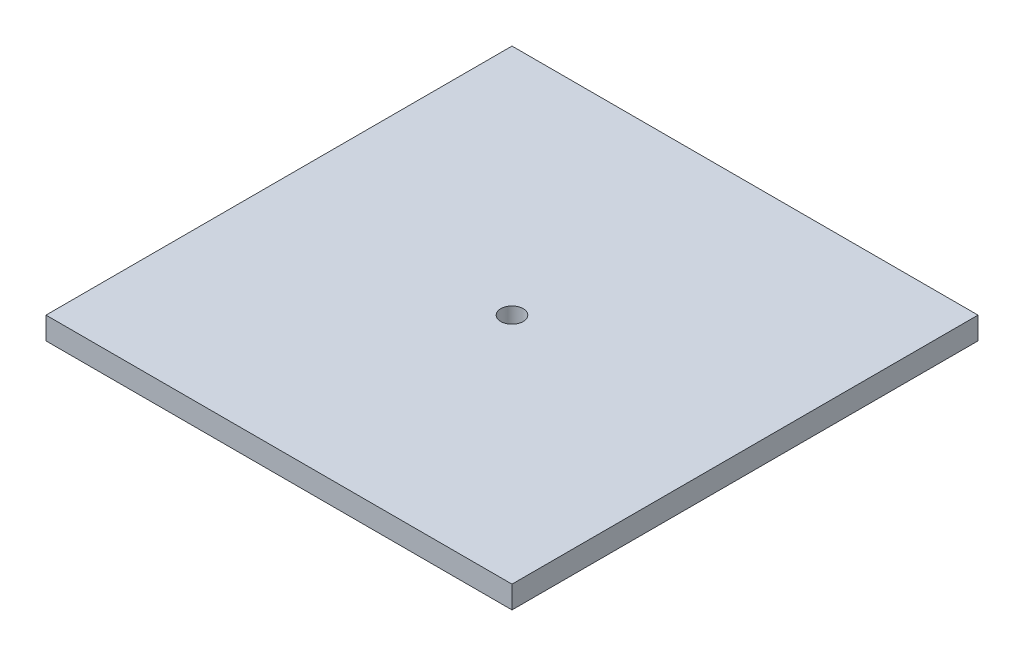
ISO-10303-21;
HEADER;
FILE_DESCRIPTION(('STEP AP214'),'2;1');
FILE_NAME('part.step','',(''),(''),'','','');
FILE_SCHEMA(('AUTOMOTIVE_DESIGN { 1 0 10303 214 1 1 1 1 }'));
ENDSEC;
DATA;
#1=APPLICATION_CONTEXT('core data for automotive mechanical design processes');
#2=APPLICATION_PROTOCOL_DEFINITION('international standard','automotive_design',2000,#1);
#3=PRODUCT_CONTEXT('',#1,'mechanical');
#4=PRODUCT('Part','Part','',(#3));
#5=PRODUCT_RELATED_PRODUCT_CATEGORY('part','',(#4));
#6=PRODUCT_DEFINITION_FORMATION('','',#4);
#7=PRODUCT_DEFINITION_CONTEXT('part definition',#1,'design');
#8=PRODUCT_DEFINITION('design','',#6,#7);
#9=PRODUCT_DEFINITION_SHAPE('','',#8);
#10=(LENGTH_UNIT() NAMED_UNIT(*) SI_UNIT(.MILLI.,.METRE.));
#11=(NAMED_UNIT(*) PLANE_ANGLE_UNIT() SI_UNIT($,.RADIAN.));
#12=(NAMED_UNIT(*) SI_UNIT($,.STERADIAN.) SOLID_ANGLE_UNIT());
#13=UNCERTAINTY_MEASURE_WITH_UNIT(LENGTH_MEASURE(1.E-05),#10,'distance_accuracy_value','');
#14=(GEOMETRIC_REPRESENTATION_CONTEXT(3) GLOBAL_UNCERTAINTY_ASSIGNED_CONTEXT((#13)) GLOBAL_UNIT_ASSIGNED_CONTEXT((#10,
#11,#12)) REPRESENTATION_CONTEXT('',''));
#15=CARTESIAN_POINT('',(0.,0.,0.));
#16=DIRECTION('',(0.,0.,1.));
#17=DIRECTION('',(1.,0.,0.));
#18=AXIS2_PLACEMENT_3D('',#15,#16,#17);
#19=CARTESIAN_POINT('',(0.,6.,-125.));
#20=DIRECTION('',(0.,-1.,0.));
#21=DIRECTION('',(0.,0.,-1.));
#22=AXIS2_PLACEMENT_3D('',#19,#20,#21);
#23=PLANE('',#22);
#24=DIRECTION('',(0.,0.,1.));
#25=VECTOR('',#24,1.);
#26=CARTESIAN_POINT('',(0.,6.,0.));
#27=LINE('',#26,#25);
#28=CARTESIAN_POINT('',(0.,6.,-125.));
#29=VERTEX_POINT('',#28);
#30=CARTESIAN_POINT('',(0.,6.,0.));
#31=VERTEX_POINT('',#30);
#32=EDGE_CURVE('E95',#29,#31,#27,.T.);
#33=ORIENTED_EDGE('',*,*,#32,.T.);
#34=DIRECTION('',(1.,0.,0.));
#35=VECTOR('',#34,1.);
#36=CARTESIAN_POINT('',(0.,6.,0.));
#37=LINE('',#36,#35);
#38=CARTESIAN_POINT('',(125.,6.,0.));
#39=VERTEX_POINT('',#38);
#40=EDGE_CURVE('E80',#31,#39,#37,.T.);
#41=ORIENTED_EDGE('',*,*,#40,.T.);
#42=DIRECTION('',(0.,0.,-1.));
#43=VECTOR('',#42,1.);
#44=CARTESIAN_POINT('',(125.,6.,0.));
#45=LINE('',#44,#43);
#46=CARTESIAN_POINT('',(125.,6.,-125.));
#47=VERTEX_POINT('',#46);
#48=EDGE_CURVE('E46',#39,#47,#45,.T.);
#49=ORIENTED_EDGE('',*,*,#48,.T.);
#50=DIRECTION('',(-1.,0.,0.));
#51=VECTOR('',#50,1.);
#52=CARTESIAN_POINT('',(0.,6.,-125.));
#53=LINE('',#52,#51);
#54=EDGE_CURVE('E41',#47,#29,#53,.T.);
#55=ORIENTED_EDGE('',*,*,#54,.T.);
#56=EDGE_LOOP('',(#33,#41,#49,#55));
#57=FACE_BOUND('',#56,.T.);
#58=CARTESIAN_POINT('',(62.5,6.,-62.5));
#59=DIRECTION('',(0.,1.,0.));
#60=DIRECTION('',(0.,0.,1.));
#61=AXIS2_PLACEMENT_3D('',#58,#59,#60);
#62=CIRCLE('',#61,3.00000000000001);
#63=CARTESIAN_POINT('',(62.5,6.,-59.5));
#64=VERTEX_POINT('',#63);
#65=EDGE_CURVE('E85',#64,#64,#62,.T.);
#66=ORIENTED_EDGE('',*,*,#65,.F.);
#67=EDGE_LOOP('',(#66));
#68=FACE_BOUND('',#67,.T.);
#69=ADVANCED_FACE('F26',(#57,#68),#23,.F.);
#70=CARTESIAN_POINT('',(0.,0.,-125.));
#71=DIRECTION('',(0.,-1.,0.));
#72=DIRECTION('',(0.,0.,-1.));
#73=AXIS2_PLACEMENT_3D('',#70,#71,#72);
#74=PLANE('',#73);
#75=DIRECTION('',(0.,0.,1.));
#76=VECTOR('',#75,1.);
#77=CARTESIAN_POINT('',(0.,0.,0.));
#78=LINE('',#77,#76);
#79=CARTESIAN_POINT('',(0.,0.,-125.));
#80=VERTEX_POINT('',#79);
#81=CARTESIAN_POINT('',(0.,0.,0.));
#82=VERTEX_POINT('',#81);
#83=EDGE_CURVE('E72',#80,#82,#78,.T.);
#84=ORIENTED_EDGE('',*,*,#83,.F.);
#85=DIRECTION('',(-1.,0.,0.));
#86=VECTOR('',#85,1.);
#87=CARTESIAN_POINT('',(0.,0.,-125.));
#88=LINE('',#87,#86);
#89=CARTESIAN_POINT('',(125.,0.,-125.));
#90=VERTEX_POINT('',#89);
#91=EDGE_CURVE('E93',#90,#80,#88,.T.);
#92=ORIENTED_EDGE('',*,*,#91,.F.);
#93=DIRECTION('',(0.,0.,-1.));
#94=VECTOR('',#93,1.);
#95=CARTESIAN_POINT('',(125.,0.,0.));
#96=LINE('',#95,#94);
#97=CARTESIAN_POINT('',(125.,0.,0.));
#98=VERTEX_POINT('',#97);
#99=EDGE_CURVE('E73',#98,#90,#96,.T.);
#100=ORIENTED_EDGE('',*,*,#99,.F.);
#101=DIRECTION('',(1.,0.,0.));
#102=VECTOR('',#101,1.);
#103=CARTESIAN_POINT('',(0.,0.,0.));
#104=LINE('',#103,#102);
#105=EDGE_CURVE('E67',#82,#98,#104,.T.);
#106=ORIENTED_EDGE('',*,*,#105,.F.);
#107=EDGE_LOOP('',(#84,#92,#100,#106));
#108=FACE_BOUND('',#107,.T.);
#109=CARTESIAN_POINT('',(62.5,0.,-62.5));
#110=DIRECTION('',(0.,1.,0.));
#111=DIRECTION('',(0.,0.,1.));
#112=AXIS2_PLACEMENT_3D('',#109,#110,#111);
#113=CIRCLE('',#112,3.00000000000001);
#114=CARTESIAN_POINT('',(62.5,0.,-59.5));
#115=VERTEX_POINT('',#114);
#116=EDGE_CURVE('E88',#115,#115,#113,.T.);
#117=ORIENTED_EDGE('',*,*,#116,.T.);
#118=EDGE_LOOP('',(#117));
#119=FACE_BOUND('',#118,.T.);
#120=ADVANCED_FACE('F68',(#108,#119),#74,.T.);
#121=CARTESIAN_POINT('',(0.,6.,0.));
#122=DIRECTION('',(1.,0.,0.));
#123=DIRECTION('',(0.,0.,-1.));
#124=AXIS2_PLACEMENT_3D('',#121,#122,#123);
#125=PLANE('',#124);
#126=ORIENTED_EDGE('',*,*,#83,.T.);
#127=DIRECTION('',(0.,-1.,0.));
#128=VECTOR('',#127,1.);
#129=CARTESIAN_POINT('',(0.,6.,0.));
#130=LINE('',#129,#128);
#131=EDGE_CURVE('E11',#31,#82,#130,.T.);
#132=ORIENTED_EDGE('',*,*,#131,.F.);
#133=ORIENTED_EDGE('',*,*,#32,.F.);
#134=DIRECTION('',(0.,-1.,0.));
#135=VECTOR('',#134,1.);
#136=CARTESIAN_POINT('',(0.,6.,-125.));
#137=LINE('',#136,#135);
#138=EDGE_CURVE('E84',#29,#80,#137,.T.);
#139=ORIENTED_EDGE('',*,*,#138,.T.);
#140=EDGE_LOOP('',(#126,#132,#133,#139));
#141=FACE_BOUND('',#140,.T.);
#142=ADVANCED_FACE('F28',(#141),#125,.F.);
#143=CARTESIAN_POINT('',(0.,6.,0.));
#144=DIRECTION('',(0.,0.,-1.));
#145=DIRECTION('',(-1.,0.,0.));
#146=AXIS2_PLACEMENT_3D('',#143,#144,#145);
#147=PLANE('',#146);
#148=ORIENTED_EDGE('',*,*,#105,.T.);
#149=DIRECTION('',(0.,-1.,0.));
#150=VECTOR('',#149,1.);
#151=CARTESIAN_POINT('',(125.,6.,0.));
#152=LINE('',#151,#150);
#153=EDGE_CURVE('E34',#39,#98,#152,.T.);
#154=ORIENTED_EDGE('',*,*,#153,.F.);
#155=ORIENTED_EDGE('',*,*,#40,.F.);
#156=ORIENTED_EDGE('',*,*,#131,.T.);
#157=EDGE_LOOP('',(#148,#154,#155,#156));
#158=FACE_BOUND('',#157,.T.);
#159=ADVANCED_FACE('F79',(#158),#147,.F.);
#160=CARTESIAN_POINT('',(125.,6.,0.));
#161=DIRECTION('',(-1.,0.,0.));
#162=DIRECTION('',(0.,0.,1.));
#163=AXIS2_PLACEMENT_3D('',#160,#161,#162);
#164=PLANE('',#163);
#165=ORIENTED_EDGE('',*,*,#99,.T.);
#166=DIRECTION('',(0.,-1.,0.));
#167=VECTOR('',#166,1.);
#168=CARTESIAN_POINT('',(125.,6.,-125.));
#169=LINE('',#168,#167);
#170=EDGE_CURVE('E101',#47,#90,#169,.T.);
#171=ORIENTED_EDGE('',*,*,#170,.F.);
#172=ORIENTED_EDGE('',*,*,#48,.F.);
#173=ORIENTED_EDGE('',*,*,#153,.T.);
#174=EDGE_LOOP('',(#165,#171,#172,#173));
#175=FACE_BOUND('',#174,.T.);
#176=ADVANCED_FACE('F104',(#175),#164,.F.);
#177=CARTESIAN_POINT('',(0.,6.,-125.));
#178=DIRECTION('',(0.,0.,1.));
#179=DIRECTION('',(1.,0.,0.));
#180=AXIS2_PLACEMENT_3D('',#177,#178,#179);
#181=PLANE('',#180);
#182=ORIENTED_EDGE('',*,*,#91,.T.);
#183=ORIENTED_EDGE('',*,*,#138,.F.);
#184=ORIENTED_EDGE('',*,*,#54,.F.);
#185=ORIENTED_EDGE('',*,*,#170,.T.);
#186=EDGE_LOOP('',(#182,#183,#184,#185));
#187=FACE_BOUND('',#186,.T.);
#188=ADVANCED_FACE('F106',(#187),#181,.F.);
#189=CARTESIAN_POINT('',(62.5,6.,-62.5));
#190=DIRECTION('',(0.,-1.,0.));
#191=DIRECTION('',(0.,0.,-1.));
#192=AXIS2_PLACEMENT_3D('',#189,#190,#191);
#193=CYLINDRICAL_SURFACE('',#192,3.00000000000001);
#194=ORIENTED_EDGE('',*,*,#65,.T.);
#195=EDGE_LOOP('',(#194));
#196=FACE_BOUND('',#195,.T.);
#197=ORIENTED_EDGE('',*,*,#116,.F.);
#198=EDGE_LOOP('',(#197));
#199=FACE_BOUND('',#198,.T.);
#200=ADVANCED_FACE('F112',(#196,#199),#193,.F.);
#201=CLOSED_SHELL('',(#69,#120,#142,#159,#176,#188,#200));
#202=MANIFOLD_SOLID_BREP('B2',#201);
#203=ADVANCED_BREP_SHAPE_REPRESENTATION('',(#18,#202),#14);
#204=SHAPE_DEFINITION_REPRESENTATION(#9,#203);
ENDSEC;
END-ISO-10303-21;
